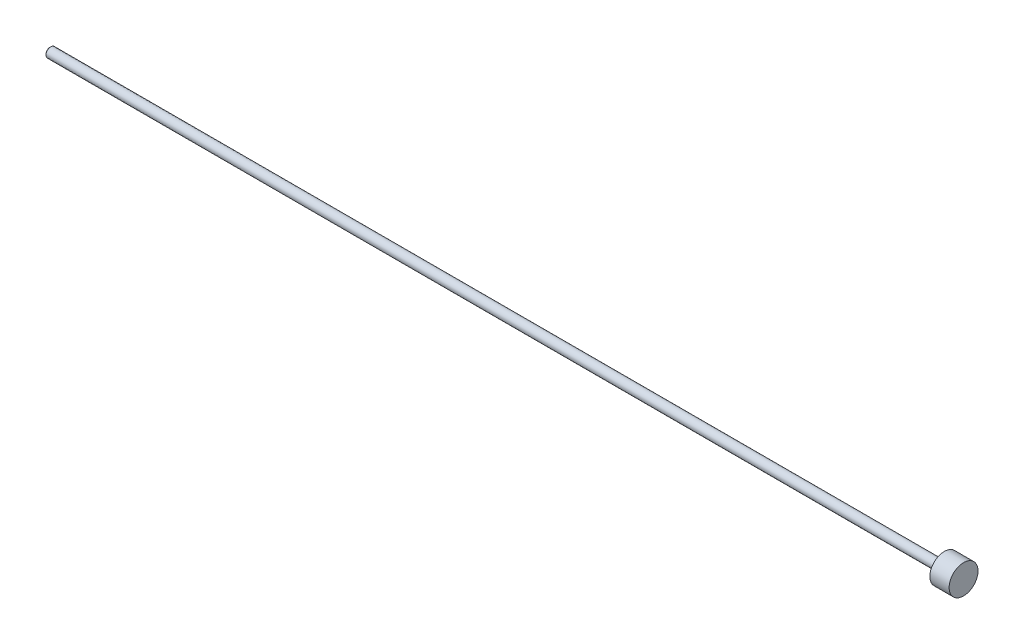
ISO-10303-21;
HEADER;
FILE_DESCRIPTION(('STEP AP214'),'2;1');
FILE_NAME('part.step','',(''),(''),'','','');
FILE_SCHEMA(('AUTOMOTIVE_DESIGN { 1 0 10303 214 1 1 1 1 }'));
ENDSEC;
DATA;
#1=APPLICATION_CONTEXT('core data for automotive mechanical design processes');
#2=APPLICATION_PROTOCOL_DEFINITION('international standard','automotive_design',2000,#1);
#3=PRODUCT_CONTEXT('',#1,'mechanical');
#4=PRODUCT('Part','Part','',(#3));
#5=PRODUCT_RELATED_PRODUCT_CATEGORY('part','',(#4));
#6=PRODUCT_DEFINITION_FORMATION('','',#4);
#7=PRODUCT_DEFINITION_CONTEXT('part definition',#1,'design');
#8=PRODUCT_DEFINITION('design','',#6,#7);
#9=PRODUCT_DEFINITION_SHAPE('','',#8);
#10=(LENGTH_UNIT() NAMED_UNIT(*) SI_UNIT(.MILLI.,.METRE.));
#11=(NAMED_UNIT(*) PLANE_ANGLE_UNIT() SI_UNIT($,.RADIAN.));
#12=(NAMED_UNIT(*) SI_UNIT($,.STERADIAN.) SOLID_ANGLE_UNIT());
#13=UNCERTAINTY_MEASURE_WITH_UNIT(LENGTH_MEASURE(1.E-05),#10,'distance_accuracy_value','');
#14=(GEOMETRIC_REPRESENTATION_CONTEXT(3) GLOBAL_UNCERTAINTY_ASSIGNED_CONTEXT((#13)) GLOBAL_UNIT_ASSIGNED_CONTEXT((#10,
#11,#12)) REPRESENTATION_CONTEXT('',''));
#15=CARTESIAN_POINT('',(0.,0.,0.));
#16=DIRECTION('',(0.,0.,1.));
#17=DIRECTION('',(1.,0.,0.));
#18=AXIS2_PLACEMENT_3D('',#15,#16,#17);
#19=CARTESIAN_POINT('',(294.995930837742,0.,0.));
#20=DIRECTION('',(1.,0.,0.));
#21=DIRECTION('',(0.,0.,-1.));
#22=AXIS2_PLACEMENT_3D('',#19,#20,#21);
#23=CYLINDRICAL_SURFACE('',#22,3.175);
#24=CARTESIAN_POINT('',(304.484186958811,0.,0.));
#25=DIRECTION('',(-1.,0.,0.));
#26=DIRECTION('',(0.,0.,1.));
#27=AXIS2_PLACEMENT_3D('',#24,#25,#26);
#28=CIRCLE('',#27,3.175);
#29=CARTESIAN_POINT('',(304.484186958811,0.,3.175));
#30=VERTEX_POINT('',#29);
#31=EDGE_CURVE('E10',#30,#30,#28,.F.);
#32=ORIENTED_EDGE('',*,*,#31,.T.);
#33=EDGE_LOOP('',(#32));
#34=FACE_BOUND('',#33,.T.);
#35=CARTESIAN_POINT('',(893.383186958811,0.,0.));
#36=DIRECTION('',(-1.,0.,0.));
#37=DIRECTION('',(0.,0.,1.));
#38=AXIS2_PLACEMENT_3D('',#35,#36,#37);
#39=CIRCLE('',#38,3.175);
#40=CARTESIAN_POINT('',(893.383186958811,0.,3.175));
#41=VERTEX_POINT('',#40);
#42=EDGE_CURVE('E42',#41,#41,#39,.T.);
#43=ORIENTED_EDGE('',*,*,#42,.T.);
#44=EDGE_LOOP('',(#43));
#45=FACE_BOUND('',#44,.T.);
#46=ADVANCED_FACE('F31',(#34,#45),#23,.T.);
#47=CARTESIAN_POINT('',(303.976186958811,0.,0.));
#48=DIRECTION('',(-1.,0.,0.));
#49=DIRECTION('',(0.,0.,1.));
#50=AXIS2_PLACEMENT_3D('',#47,#48,#49);
#51=PLANE('',#50);
#52=CARTESIAN_POINT('',(303.976186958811,0.,0.));
#53=DIRECTION('',(-1.,0.,0.));
#54=DIRECTION('',(0.,0.,1.));
#55=AXIS2_PLACEMENT_3D('',#52,#53,#54);
#56=CIRCLE('',#55,2.66699999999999);
#57=CARTESIAN_POINT('',(303.976186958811,0.,2.66699999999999));
#58=VERTEX_POINT('',#57);
#59=EDGE_CURVE('E38',#58,#58,#56,.T.);
#60=ORIENTED_EDGE('',*,*,#59,.T.);
#61=EDGE_LOOP('',(#60));
#62=FACE_BOUND('',#61,.T.);
#63=ADVANCED_FACE('F73',(#62),#51,.T.);
#64=CARTESIAN_POINT('',(893.383186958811,0.,0.));
#65=DIRECTION('',(-1.,0.,0.));
#66=DIRECTION('',(0.,0.,1.));
#67=AXIS2_PLACEMENT_3D('',#64,#65,#66);
#68=PLANE('',#67);
#69=CARTESIAN_POINT('',(893.383186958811,0.,0.));
#70=DIRECTION('',(-1.,0.,0.));
#71=DIRECTION('',(0.,0.,1.));
#72=AXIS2_PLACEMENT_3D('',#69,#70,#71);
#73=CIRCLE('',#72,9.52500000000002);
#74=CARTESIAN_POINT('',(893.383186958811,0.,9.52500000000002));
#75=VERTEX_POINT('',#74);
#76=EDGE_CURVE('E46',#75,#75,#73,.T.);
#77=ORIENTED_EDGE('',*,*,#76,.T.);
#78=EDGE_LOOP('',(#77));
#79=FACE_BOUND('',#78,.T.);
#80=ORIENTED_EDGE('',*,*,#42,.F.);
#81=EDGE_LOOP('',(#80));
#82=FACE_BOUND('',#81,.T.);
#83=ADVANCED_FACE('F55',(#79,#82),#68,.T.);
#84=CARTESIAN_POINT('',(893.383186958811,0.,0.));
#85=DIRECTION('',(1.,0.,0.));
#86=DIRECTION('',(0.,0.,-1.));
#87=AXIS2_PLACEMENT_3D('',#84,#85,#86);
#88=CYLINDRICAL_SURFACE('',#87,9.52500000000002);
#89=ORIENTED_EDGE('',*,*,#76,.F.);
#90=EDGE_LOOP('',(#89));
#91=FACE_BOUND('',#90,.T.);
#92=CARTESIAN_POINT('',(906.083186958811,0.,0.));
#93=DIRECTION('',(-1.,0.,0.));
#94=DIRECTION('',(0.,0.,1.));
#95=AXIS2_PLACEMENT_3D('',#92,#93,#94);
#96=CIRCLE('',#95,9.52500000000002);
#97=CARTESIAN_POINT('',(906.083186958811,0.,9.52500000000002));
#98=VERTEX_POINT('',#97);
#99=EDGE_CURVE('E49',#98,#98,#96,.T.);
#100=ORIENTED_EDGE('',*,*,#99,.T.);
#101=EDGE_LOOP('',(#100));
#102=FACE_BOUND('',#101,.T.);
#103=ADVANCED_FACE('F58',(#91,#102),#88,.T.);
#104=CARTESIAN_POINT('',(906.083186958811,0.,0.));
#105=DIRECTION('',(-1.,0.,0.));
#106=DIRECTION('',(0.,0.,1.));
#107=AXIS2_PLACEMENT_3D('',#104,#105,#106);
#108=PLANE('',#107);
#109=ORIENTED_EDGE('',*,*,#99,.F.);
#110=EDGE_LOOP('',(#109));
#111=FACE_BOUND('',#110,.T.);
#112=ADVANCED_FACE('F61',(#111),#108,.F.);
#113=CARTESIAN_POINT('',(303.976186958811,0.,0.));
#114=DIRECTION('',(1.,0.,0.));
#115=DIRECTION('',(0.,0.,-1.));
#116=AXIS2_PLACEMENT_3D('',#113,#114,#115);
#117=CONICAL_SURFACE('',#116,2.66699999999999,0.785398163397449);
#118=ORIENTED_EDGE('',*,*,#31,.F.);
#119=EDGE_LOOP('',(#118));
#120=FACE_BOUND('',#119,.T.);
#121=ORIENTED_EDGE('',*,*,#59,.F.);
#122=EDGE_LOOP('',(#121));
#123=FACE_BOUND('',#122,.T.);
#124=ADVANCED_FACE('F33',(#120,#123),#117,.T.);
#125=CLOSED_SHELL('',(#46,#63,#83,#103,#112,#124));
#126=MANIFOLD_SOLID_BREP('B2',#125);
#127=ADVANCED_BREP_SHAPE_REPRESENTATION('',(#18,#126),#14);
#128=SHAPE_DEFINITION_REPRESENTATION(#9,#127);
ENDSEC;
END-ISO-10303-21;
